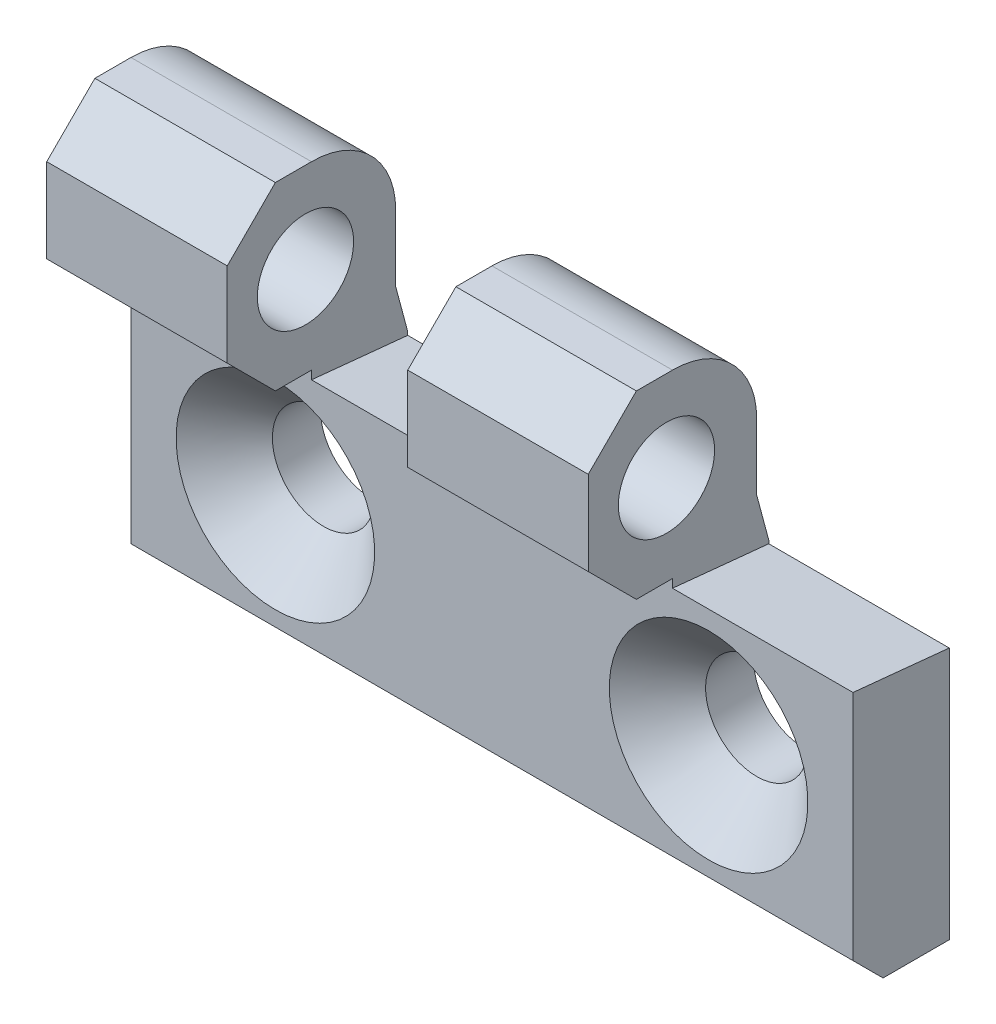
ISO-10303-21;
HEADER;
FILE_DESCRIPTION(('STEP AP214'),'2;1');
FILE_NAME('part.step','',(''),(''),'','','');
FILE_SCHEMA(('AUTOMOTIVE_DESIGN { 1 0 10303 214 1 1 1 1 }'));
ENDSEC;
DATA;
#1=APPLICATION_CONTEXT('core data for automotive mechanical design processes');
#2=APPLICATION_PROTOCOL_DEFINITION('international standard','automotive_design',2000,#1);
#3=PRODUCT_CONTEXT('',#1,'mechanical');
#4=PRODUCT('Part','Part','',(#3));
#5=PRODUCT_RELATED_PRODUCT_CATEGORY('part','',(#4));
#6=PRODUCT_DEFINITION_FORMATION('','',#4);
#7=PRODUCT_DEFINITION_CONTEXT('part definition',#1,'design');
#8=PRODUCT_DEFINITION('design','',#6,#7);
#9=PRODUCT_DEFINITION_SHAPE('','',#8);
#10=(LENGTH_UNIT() NAMED_UNIT(*) SI_UNIT(.MILLI.,.METRE.));
#11=(NAMED_UNIT(*) PLANE_ANGLE_UNIT() SI_UNIT($,.RADIAN.));
#12=(NAMED_UNIT(*) SI_UNIT($,.STERADIAN.) SOLID_ANGLE_UNIT());
#13=UNCERTAINTY_MEASURE_WITH_UNIT(LENGTH_MEASURE(1.E-05),#10,'distance_accuracy_value','');
#14=(GEOMETRIC_REPRESENTATION_CONTEXT(3) GLOBAL_UNCERTAINTY_ASSIGNED_CONTEXT((#13)) GLOBAL_UNIT_ASSIGNED_CONTEXT((#10,
#11,#12)) REPRESENTATION_CONTEXT('',''));
#15=CARTESIAN_POINT('',(0.,0.,0.));
#16=DIRECTION('',(0.,0.,1.));
#17=DIRECTION('',(1.,0.,0.));
#18=AXIS2_PLACEMENT_3D('',#15,#16,#17);
#19=CARTESIAN_POINT('',(-12.,9.,0.));
#20=DIRECTION('',(0.,0.995037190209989,-0.0995037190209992));
#21=DIRECTION('',(0.,0.0995037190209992,0.995037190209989));
#22=AXIS2_PLACEMENT_3D('',#19,#20,#21);
#23=PLANE('',#22);
#24=DIRECTION('',(0.,-0.0995037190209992,-0.995037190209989));
#25=VECTOR('',#24,1.);
#26=CARTESIAN_POINT('',(3.,9.,0.));
#27=LINE('',#26,#25);
#28=CARTESIAN_POINT('',(3.,9.8,8.));
#29=VERTEX_POINT('',#28);
#30=CARTESIAN_POINT('',(3.,9.,0.));
#31=VERTEX_POINT('',#30);
#32=EDGE_CURVE('E30',#29,#31,#27,.T.);
#33=ORIENTED_EDGE('',*,*,#32,.F.);
#34=DIRECTION('',(1.,0.,0.));
#35=VECTOR('',#34,1.);
#36=CARTESIAN_POINT('',(-12.,9.8,8.));
#37=LINE('',#36,#35);
#38=CARTESIAN_POINT('',(18.,9.8,8.));
#39=VERTEX_POINT('',#38);
#40=EDGE_CURVE('E402',#29,#39,#37,.T.);
#41=ORIENTED_EDGE('',*,*,#40,.T.);
#42=DIRECTION('',(0.,-0.0995037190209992,-0.995037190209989));
#43=VECTOR('',#42,1.);
#44=CARTESIAN_POINT('',(18.,9.,0.));
#45=LINE('',#44,#43);
#46=CARTESIAN_POINT('',(18.,9.,0.));
#47=VERTEX_POINT('',#46);
#48=EDGE_CURVE('E368',#39,#47,#45,.T.);
#49=ORIENTED_EDGE('',*,*,#48,.T.);
#50=DIRECTION('',(1.,0.,0.));
#51=VECTOR('',#50,1.);
#52=CARTESIAN_POINT('',(-12.,9.,0.));
#53=LINE('',#52,#51);
#54=EDGE_CURVE('E23',#31,#47,#53,.T.);
#55=ORIENTED_EDGE('',*,*,#54,.F.);
#56=EDGE_LOOP('',(#33,#41,#49,#55));
#57=FACE_BOUND('',#56,.T.);
#58=ADVANCED_FACE('F15',(#57),#23,.T.);
#59=CARTESIAN_POINT('',(-12.,-12.,5.5));
#60=DIRECTION('',(0.,-1.,0.));
#61=DIRECTION('',(1.,0.,0.));
#62=AXIS2_PLACEMENT_3D('',#59,#60,#61);
#63=PLANE('',#62);
#64=DIRECTION('',(1.,0.,0.));
#65=VECTOR('',#64,1.);
#66=CARTESIAN_POINT('',(-12.,-12.,0.));
#67=LINE('',#66,#65);
#68=CARTESIAN_POINT('',(-12.,-12.,0.));
#69=VERTEX_POINT('',#68);
#70=CARTESIAN_POINT('',(48.,-12.,0.));
#71=VERTEX_POINT('',#70);
#72=EDGE_CURVE('E9',#69,#71,#67,.T.);
#73=ORIENTED_EDGE('',*,*,#72,.T.);
#74=DIRECTION('',(0.,0.,-1.));
#75=VECTOR('',#74,1.);
#76=CARTESIAN_POINT('',(48.,-12.,5.5));
#77=LINE('',#76,#75);
#78=CARTESIAN_POINT('',(48.,-12.,5.5));
#79=VERTEX_POINT('',#78);
#80=EDGE_CURVE('E373',#79,#71,#77,.T.);
#81=ORIENTED_EDGE('',*,*,#80,.F.);
#82=DIRECTION('',(1.,0.,0.));
#83=VECTOR('',#82,1.);
#84=CARTESIAN_POINT('',(-12.,-12.,5.5));
#85=LINE('',#84,#83);
#86=CARTESIAN_POINT('',(-12.,-12.,5.5));
#87=VERTEX_POINT('',#86);
#88=EDGE_CURVE('E395',#87,#79,#85,.T.);
#89=ORIENTED_EDGE('',*,*,#88,.F.);
#90=DIRECTION('',(0.,0.,-1.));
#91=VECTOR('',#90,1.);
#92=CARTESIAN_POINT('',(-12.,-12.,5.5));
#93=LINE('',#92,#91);
#94=EDGE_CURVE('E386',#87,#69,#93,.T.);
#95=ORIENTED_EDGE('',*,*,#94,.T.);
#96=EDGE_LOOP('',(#73,#81,#89,#95));
#97=FACE_BOUND('',#96,.T.);
#98=ADVANCED_FACE('F17',(#97),#63,.T.);
#99=CARTESIAN_POINT('',(-12.,-12.,0.));
#100=DIRECTION('',(0.,0.,-1.));
#101=DIRECTION('',(-1.,0.,0.));
#102=AXIS2_PLACEMENT_3D('',#99,#100,#101);
#103=PLANE('',#102);
#104=CARTESIAN_POINT('',(0.,0.,0.));
#105=DIRECTION('',(0.,0.,1.));
#106=DIRECTION('',(0.,-1.,0.));
#107=AXIS2_PLACEMENT_3D('',#104,#105,#106);
#108=CIRCLE('',#107,4.25);
#109=CARTESIAN_POINT('',(0.,-4.25,0.));
#110=VERTEX_POINT('',#109);
#111=EDGE_CURVE('E537',#110,#110,#108,.T.);
#112=ORIENTED_EDGE('',*,*,#111,.T.);
#113=EDGE_LOOP('',(#112));
#114=FACE_BOUND('',#113,.T.);
#115=CARTESIAN_POINT('',(36.,0.,0.));
#116=DIRECTION('',(0.,0.,1.));
#117=DIRECTION('',(0.,-1.,0.));
#118=AXIS2_PLACEMENT_3D('',#115,#116,#117);
#119=CIRCLE('',#118,4.25);
#120=CARTESIAN_POINT('',(36.,-4.25,0.));
#121=VERTEX_POINT('',#120);
#122=EDGE_CURVE('E540',#121,#121,#119,.T.);
#123=ORIENTED_EDGE('',*,*,#122,.T.);
#124=EDGE_LOOP('',(#123));
#125=FACE_BOUND('',#124,.T.);
#126=DIRECTION('',(0.,1.,0.));
#127=VECTOR('',#126,1.);
#128=CARTESIAN_POINT('',(-12.,-12.,0.));
#129=LINE('',#128,#127);
#130=CARTESIAN_POINT('',(-12.,9.2679491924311,0.));
#131=VERTEX_POINT('',#130);
#132=EDGE_CURVE('E193',#69,#131,#129,.T.);
#133=ORIENTED_EDGE('',*,*,#132,.T.);
#134=DIRECTION('',(1.,0.,0.));
#135=VECTOR('',#134,1.);
#136=CARTESIAN_POINT('',(-12.,9.2679491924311,0.));
#137=LINE('',#136,#135);
#138=CARTESIAN_POINT('',(3.,9.2679491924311,0.));
#139=VERTEX_POINT('',#138);
#140=EDGE_CURVE('E190',#131,#139,#137,.T.);
#141=ORIENTED_EDGE('',*,*,#140,.T.);
#142=DIRECTION('',(0.,1.,0.));
#143=VECTOR('',#142,1.);
#144=CARTESIAN_POINT('',(3.,2.,0.));
#145=LINE('',#144,#143);
#146=EDGE_CURVE('E179',#31,#139,#145,.T.);
#147=ORIENTED_EDGE('',*,*,#146,.F.);
#148=ORIENTED_EDGE('',*,*,#54,.T.);
#149=DIRECTION('',(0.,1.,0.));
#150=VECTOR('',#149,1.);
#151=CARTESIAN_POINT('',(18.,2.,0.));
#152=LINE('',#151,#150);
#153=CARTESIAN_POINT('',(18.,9.2679491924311,0.));
#154=VERTEX_POINT('',#153);
#155=EDGE_CURVE('E283',#47,#154,#152,.T.);
#156=ORIENTED_EDGE('',*,*,#155,.T.);
#157=DIRECTION('',(-1.,0.,0.));
#158=VECTOR('',#157,1.);
#159=CARTESIAN_POINT('',(33.,9.2679491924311,0.));
#160=LINE('',#159,#158);
#161=CARTESIAN_POINT('',(33.,9.2679491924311,0.));
#162=VERTEX_POINT('',#161);
#163=EDGE_CURVE('E365',#162,#154,#160,.T.);
#164=ORIENTED_EDGE('',*,*,#163,.F.);
#165=DIRECTION('',(0.,1.,0.));
#166=VECTOR('',#165,1.);
#167=CARTESIAN_POINT('',(33.,2.,0.));
#168=LINE('',#167,#166);
#169=CARTESIAN_POINT('',(33.,9.,0.));
#170=VERTEX_POINT('',#169);
#171=EDGE_CURVE('E318',#170,#162,#168,.T.);
#172=ORIENTED_EDGE('',*,*,#171,.F.);
#173=CARTESIAN_POINT('',(48.,9.,0.));
#174=VERTEX_POINT('',#173);
#175=EDGE_CURVE('E403',#170,#174,#53,.T.);
#176=ORIENTED_EDGE('',*,*,#175,.T.);
#177=DIRECTION('',(0.,1.,0.));
#178=VECTOR('',#177,1.);
#179=CARTESIAN_POINT('',(48.,-12.,0.));
#180=LINE('',#179,#178);
#181=EDGE_CURVE('E374',#71,#174,#180,.T.);
#182=ORIENTED_EDGE('',*,*,#181,.F.);
#183=ORIENTED_EDGE('',*,*,#72,.F.);
#184=EDGE_LOOP('',(#133,#141,#147,#148,#156,#164,#172,#176,#182,#183));
#185=FACE_BOUND('',#184,.T.);
#186=ADVANCED_FACE('F191',(#114,#125,#185),#103,.T.);
#187=DIRECTION('',(0.,-0.0995037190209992,-0.995037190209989));
#188=VECTOR('',#187,1.);
#189=CARTESIAN_POINT('',(33.,9.,0.));
#190=LINE('',#189,#188);
#191=CARTESIAN_POINT('',(33.,9.8,8.));
#192=VERTEX_POINT('',#191);
#193=EDGE_CURVE('E371',#192,#170,#190,.T.);
#194=ORIENTED_EDGE('',*,*,#193,.F.);
#195=CARTESIAN_POINT('',(48.,9.8,8.));
#196=VERTEX_POINT('',#195);
#197=EDGE_CURVE('E401',#192,#196,#37,.T.);
#198=ORIENTED_EDGE('',*,*,#197,.T.);
#199=DIRECTION('',(0.,0.0995037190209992,0.995037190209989));
#200=VECTOR('',#199,1.);
#201=CARTESIAN_POINT('',(48.,9.,0.));
#202=LINE('',#201,#200);
#203=EDGE_CURVE('E377',#174,#196,#202,.T.);
#204=ORIENTED_EDGE('',*,*,#203,.F.);
#205=ORIENTED_EDGE('',*,*,#175,.F.);
#206=EDGE_LOOP('',(#194,#198,#204,#205));
#207=FACE_BOUND('',#206,.T.);
#208=ADVANCED_FACE('F415',(#207),#23,.T.);
#209=CARTESIAN_POINT('',(-12.,9.8,8.));
#210=DIRECTION('',(0.,0.,1.));
#211=DIRECTION('',(1.,0.,0.));
#212=AXIS2_PLACEMENT_3D('',#209,#210,#211);
#213=PLANE('',#212);
#214=CARTESIAN_POINT('',(0.,0.,8.));
#215=DIRECTION('',(0.,0.,1.));
#216=DIRECTION('',(0.,-1.,0.));
#217=AXIS2_PLACEMENT_3D('',#214,#215,#216);
#218=CIRCLE('',#217,8.25);
#219=CARTESIAN_POINT('',(0.,-8.25,8.));
#220=VERTEX_POINT('',#219);
#221=EDGE_CURVE('E543',#220,#220,#218,.T.);
#222=ORIENTED_EDGE('',*,*,#221,.F.);
#223=EDGE_LOOP('',(#222));
#224=FACE_BOUND('',#223,.T.);
#225=CARTESIAN_POINT('',(36.,0.,8.));
#226=DIRECTION('',(0.,0.,1.));
#227=DIRECTION('',(0.,-1.,0.));
#228=AXIS2_PLACEMENT_3D('',#225,#226,#227);
#229=CIRCLE('',#228,8.25);
#230=CARTESIAN_POINT('',(36.,-8.25,8.));
#231=VERTEX_POINT('',#230);
#232=EDGE_CURVE('E187',#231,#231,#229,.T.);
#233=ORIENTED_EDGE('',*,*,#232,.F.);
#234=EDGE_LOOP('',(#233));
#235=FACE_BOUND('',#234,.T.);
#236=DIRECTION('',(0.,-1.,0.));
#237=VECTOR('',#236,1.);
#238=CARTESIAN_POINT('',(-12.,9.8,8.));
#239=LINE('',#238,#237);
#240=CARTESIAN_POINT('',(-12.,10.5,8.));
#241=VERTEX_POINT('',#240);
#242=CARTESIAN_POINT('',(-12.,-9.5,8.));
#243=VERTEX_POINT('',#242);
#244=EDGE_CURVE('E390',#241,#243,#239,.T.);
#245=ORIENTED_EDGE('',*,*,#244,.T.);
#246=DIRECTION('',(1.,0.,0.));
#247=VECTOR('',#246,1.);
#248=CARTESIAN_POINT('',(-12.,-9.5,8.));
#249=LINE('',#248,#247);
#250=CARTESIAN_POINT('',(48.,-9.5,8.));
#251=VERTEX_POINT('',#250);
#252=EDGE_CURVE('E399',#243,#251,#249,.T.);
#253=ORIENTED_EDGE('',*,*,#252,.T.);
#254=DIRECTION('',(0.,-1.,0.));
#255=VECTOR('',#254,1.);
#256=CARTESIAN_POINT('',(48.,9.8,8.));
#257=LINE('',#256,#255);
#258=EDGE_CURVE('E380',#196,#251,#257,.T.);
#259=ORIENTED_EDGE('',*,*,#258,.F.);
#260=ORIENTED_EDGE('',*,*,#197,.F.);
#261=DIRECTION('',(0.,-1.,0.));
#262=VECTOR('',#261,1.);
#263=CARTESIAN_POINT('',(33.,10.5,8.));
#264=LINE('',#263,#262);
#265=CARTESIAN_POINT('',(33.,10.5,8.));
#266=VERTEX_POINT('',#265);
#267=EDGE_CURVE('E336',#266,#192,#264,.T.);
#268=ORIENTED_EDGE('',*,*,#267,.F.);
#269=DIRECTION('',(-1.,0.,0.));
#270=VECTOR('',#269,1.);
#271=CARTESIAN_POINT('',(33.,10.5,8.));
#272=LINE('',#271,#270);
#273=CARTESIAN_POINT('',(18.,10.5,8.));
#274=VERTEX_POINT('',#273);
#275=EDGE_CURVE('E341',#266,#274,#272,.T.);
#276=ORIENTED_EDGE('',*,*,#275,.T.);
#277=DIRECTION('',(0.,-1.,0.));
#278=VECTOR('',#277,1.);
#279=CARTESIAN_POINT('',(18.,10.5,8.));
#280=LINE('',#279,#278);
#281=EDGE_CURVE('E310',#274,#39,#280,.T.);
#282=ORIENTED_EDGE('',*,*,#281,.T.);
#283=ORIENTED_EDGE('',*,*,#40,.F.);
#284=DIRECTION('',(0.,-1.,0.));
#285=VECTOR('',#284,1.);
#286=CARTESIAN_POINT('',(3.,10.5,8.));
#287=LINE('',#286,#285);
#288=CARTESIAN_POINT('',(3.,10.5,8.));
#289=VERTEX_POINT('',#288);
#290=EDGE_CURVE('E234',#289,#29,#287,.T.);
#291=ORIENTED_EDGE('',*,*,#290,.F.);
#292=DIRECTION('',(1.,0.,0.));
#293=VECTOR('',#292,1.);
#294=CARTESIAN_POINT('',(-12.,10.5,8.));
#295=LINE('',#294,#293);
#296=EDGE_CURVE('E267',#241,#289,#295,.T.);
#297=ORIENTED_EDGE('',*,*,#296,.F.);
#298=EDGE_LOOP('',(#245,#253,#259,#260,#268,#276,#282,#283,#291,#297));
#299=FACE_BOUND('',#298,.T.);
#300=ADVANCED_FACE('F419',(#224,#235,#299),#213,.T.);
#301=CARTESIAN_POINT('',(-12.,-9.5,8.));
#302=DIRECTION('',(0.,-0.707106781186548,0.707106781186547));
#303=DIRECTION('',(0.,-0.707106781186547,-0.707106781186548));
#304=AXIS2_PLACEMENT_3D('',#301,#302,#303);
#305=PLANE('',#304);
#306=ORIENTED_EDGE('',*,*,#88,.T.);
#307=DIRECTION('',(0.,-0.707106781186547,-0.707106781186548));
#308=VECTOR('',#307,1.);
#309=CARTESIAN_POINT('',(48.,-9.5,8.));
#310=LINE('',#309,#308);
#311=EDGE_CURVE('E383',#251,#79,#310,.T.);
#312=ORIENTED_EDGE('',*,*,#311,.F.);
#313=ORIENTED_EDGE('',*,*,#252,.F.);
#314=DIRECTION('',(0.,-0.707106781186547,-0.707106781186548));
#315=VECTOR('',#314,1.);
#316=CARTESIAN_POINT('',(-12.,-9.5,8.));
#317=LINE('',#316,#315);
#318=EDGE_CURVE('E392',#243,#87,#317,.T.);
#319=ORIENTED_EDGE('',*,*,#318,.T.);
#320=EDGE_LOOP('',(#306,#312,#313,#319));
#321=FACE_BOUND('',#320,.T.);
#322=ADVANCED_FACE('F423',(#321),#305,.T.);
#323=CARTESIAN_POINT('',(-12.,-12.,0.));
#324=DIRECTION('',(1.,0.,0.));
#325=DIRECTION('',(0.,1.,0.));
#326=AXIS2_PLACEMENT_3D('',#323,#324,#325);
#327=PLANE('',#326);
#328=ORIENTED_EDGE('',*,*,#318,.F.);
#329=ORIENTED_EDGE('',*,*,#244,.F.);
#330=DIRECTION('',(0.,0.,-1.));
#331=VECTOR('',#330,1.);
#332=CARTESIAN_POINT('',(-12.,10.5,11.));
#333=LINE('',#332,#331);
#334=CARTESIAN_POINT('',(-12.,10.5,11.));
#335=VERTEX_POINT('',#334);
#336=EDGE_CURVE('E261',#335,#241,#333,.T.);
#337=ORIENTED_EDGE('',*,*,#336,.F.);
#338=DIRECTION('',(0.,-0.707106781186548,-0.707106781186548));
#339=VECTOR('',#338,1.);
#340=CARTESIAN_POINT('',(-12.,14.5,15.));
#341=LINE('',#340,#339);
#342=CARTESIAN_POINT('',(-12.,14.5,15.));
#343=VERTEX_POINT('',#342);
#344=EDGE_CURVE('E258',#343,#335,#341,.T.);
#345=ORIENTED_EDGE('',*,*,#344,.F.);
#346=DIRECTION('',(0.,-1.,0.));
#347=VECTOR('',#346,1.);
#348=CARTESIAN_POINT('',(-12.,21.5,15.));
#349=LINE('',#348,#347);
#350=CARTESIAN_POINT('',(-12.,21.5,15.));
#351=VERTEX_POINT('',#350);
#352=EDGE_CURVE('E255',#351,#343,#349,.T.);
#353=ORIENTED_EDGE('',*,*,#352,.F.);
#354=DIRECTION('',(0.,-0.707106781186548,0.707106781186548));
#355=VECTOR('',#354,1.);
#356=CARTESIAN_POINT('',(-12.,25.5,11.));
#357=LINE('',#356,#355);
#358=CARTESIAN_POINT('',(-12.,25.5,11.));
#359=VERTEX_POINT('',#358);
#360=EDGE_CURVE('E252',#359,#351,#357,.T.);
#361=ORIENTED_EDGE('',*,*,#360,.F.);
#362=DIRECTION('',(0.,0.,1.));
#363=VECTOR('',#362,1.);
#364=CARTESIAN_POINT('',(-12.,25.5,8.));
#365=LINE('',#364,#363);
#366=CARTESIAN_POINT('',(-12.,25.5,8.00000000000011));
#367=VERTEX_POINT('',#366);
#368=EDGE_CURVE('E249',#367,#359,#365,.T.);
#369=ORIENTED_EDGE('',*,*,#368,.F.);
#370=CARTESIAN_POINT('',(-12.,18.5,8.00000000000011));
#371=DIRECTION('',(1.,0.,0.));
#372=DIRECTION('',(0.,-1.,0.));
#373=AXIS2_PLACEMENT_3D('',#370,#371,#372);
#374=CIRCLE('',#373,7.00000000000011);
#375=CARTESIAN_POINT('',(-12.,18.5,1.));
#376=VERTEX_POINT('',#375);
#377=EDGE_CURVE('E246',#376,#367,#374,.T.);
#378=ORIENTED_EDGE('',*,*,#377,.F.);
#379=DIRECTION('',(0.,1.,0.));
#380=VECTOR('',#379,1.);
#381=CARTESIAN_POINT('',(-12.,13.,1.));
#382=LINE('',#381,#380);
#383=CARTESIAN_POINT('',(-12.,13.,1.));
#384=VERTEX_POINT('',#383);
#385=EDGE_CURVE('E243',#384,#376,#382,.T.);
#386=ORIENTED_EDGE('',*,*,#385,.F.);
#387=DIRECTION('',(0.,0.965925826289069,0.258819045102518));
#388=VECTOR('',#387,1.);
#389=CARTESIAN_POINT('',(-12.,9.2679491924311,0.));
#390=LINE('',#389,#388);
#391=EDGE_CURVE('E241',#131,#384,#390,.T.);
#392=ORIENTED_EDGE('',*,*,#391,.F.);
#393=ORIENTED_EDGE('',*,*,#132,.F.);
#394=ORIENTED_EDGE('',*,*,#94,.F.);
#395=EDGE_LOOP('',(#328,#329,#337,#345,#353,#361,#369,#378,#386,#392,#393,#394));
#396=FACE_BOUND('',#395,.T.);
#397=CARTESIAN_POINT('',(-12.,18.,8.5));
#398=DIRECTION('',(1.,0.,0.));
#399=DIRECTION('',(0.,1.,0.));
#400=AXIS2_PLACEMENT_3D('',#397,#398,#399);
#401=CIRCLE('',#400,4.);
#402=CARTESIAN_POINT('',(-12.,22.,8.5));
#403=VERTEX_POINT('',#402);
#404=EDGE_CURVE('E264',#403,#403,#401,.T.);
#405=ORIENTED_EDGE('',*,*,#404,.T.);
#406=EDGE_LOOP('',(#405));
#407=FACE_BOUND('',#406,.T.);
#408=ADVANCED_FACE('F428',(#396,#407),#327,.F.);
#409=CARTESIAN_POINT('',(48.,-12.,0.));
#410=DIRECTION('',(1.,0.,0.));
#411=DIRECTION('',(0.,1.,0.));
#412=AXIS2_PLACEMENT_3D('',#409,#410,#411);
#413=PLANE('',#412);
#414=ORIENTED_EDGE('',*,*,#80,.T.);
#415=ORIENTED_EDGE('',*,*,#181,.T.);
#416=ORIENTED_EDGE('',*,*,#203,.T.);
#417=ORIENTED_EDGE('',*,*,#258,.T.);
#418=ORIENTED_EDGE('',*,*,#311,.T.);
#419=EDGE_LOOP('',(#414,#415,#416,#417,#418));
#420=FACE_BOUND('',#419,.T.);
#421=ADVANCED_FACE('F412',(#420),#413,.T.);
#422=CARTESIAN_POINT('',(33.,9.2679491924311,0.));
#423=DIRECTION('',(0.,-0.258819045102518,0.965925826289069));
#424=DIRECTION('',(0.,-0.965925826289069,-0.258819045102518));
#425=AXIS2_PLACEMENT_3D('',#422,#423,#424);
#426=PLANE('',#425);
#427=DIRECTION('',(0.,0.965925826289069,0.258819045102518));
#428=VECTOR('',#427,1.);
#429=CARTESIAN_POINT('',(18.,9.2679491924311,0.));
#430=LINE('',#429,#428);
#431=CARTESIAN_POINT('',(18.,13.,1.));
#432=VERTEX_POINT('',#431);
#433=EDGE_CURVE('E286',#154,#432,#430,.T.);
#434=ORIENTED_EDGE('',*,*,#433,.T.);
#435=DIRECTION('',(-1.,0.,0.));
#436=VECTOR('',#435,1.);
#437=CARTESIAN_POINT('',(33.,13.,1.));
#438=LINE('',#437,#436);
#439=CARTESIAN_POINT('',(33.,13.,1.));
#440=VERTEX_POINT('',#439);
#441=EDGE_CURVE('E362',#440,#432,#438,.T.);
#442=ORIENTED_EDGE('',*,*,#441,.F.);
#443=DIRECTION('',(0.,0.965925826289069,0.258819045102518));
#444=VECTOR('',#443,1.);
#445=CARTESIAN_POINT('',(33.,9.2679491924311,0.));
#446=LINE('',#445,#444);
#447=EDGE_CURVE('E320',#162,#440,#446,.T.);
#448=ORIENTED_EDGE('',*,*,#447,.F.);
#449=ORIENTED_EDGE('',*,*,#163,.T.);
#450=EDGE_LOOP('',(#434,#442,#448,#449));
#451=FACE_BOUND('',#450,.T.);
#452=ADVANCED_FACE('F469',(#451),#426,.F.);
#453=CARTESIAN_POINT('',(33.,13.,1.));
#454=DIRECTION('',(0.,0.,1.));
#455=DIRECTION('',(1.,0.,0.));
#456=AXIS2_PLACEMENT_3D('',#453,#454,#455);
#457=PLANE('',#456);
#458=DIRECTION('',(0.,1.,0.));
#459=VECTOR('',#458,1.);
#460=CARTESIAN_POINT('',(18.,13.,1.));
#461=LINE('',#460,#459);
#462=CARTESIAN_POINT('',(18.,18.5,1.));
#463=VERTEX_POINT('',#462);
#464=EDGE_CURVE('E289',#432,#463,#461,.T.);
#465=ORIENTED_EDGE('',*,*,#464,.T.);
#466=DIRECTION('',(-1.,0.,0.));
#467=VECTOR('',#466,1.);
#468=CARTESIAN_POINT('',(33.,18.5,1.));
#469=LINE('',#468,#467);
#470=CARTESIAN_POINT('',(33.,18.5,1.));
#471=VERTEX_POINT('',#470);
#472=EDGE_CURVE('E359',#471,#463,#469,.T.);
#473=ORIENTED_EDGE('',*,*,#472,.F.);
#474=DIRECTION('',(0.,1.,0.));
#475=VECTOR('',#474,1.);
#476=CARTESIAN_POINT('',(33.,13.,1.));
#477=LINE('',#476,#475);
#478=EDGE_CURVE('E322',#440,#471,#477,.T.);
#479=ORIENTED_EDGE('',*,*,#478,.F.);
#480=ORIENTED_EDGE('',*,*,#441,.T.);
#481=EDGE_LOOP('',(#465,#473,#479,#480));
#482=FACE_BOUND('',#481,.T.);
#483=ADVANCED_FACE('F505',(#482),#457,.F.);
#484=CARTESIAN_POINT('',(33.,18.5,8.00000000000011));
#485=DIRECTION('',(-1.,0.,0.));
#486=DIRECTION('',(0.,-1.,0.));
#487=AXIS2_PLACEMENT_3D('',#484,#485,#486);
#488=CYLINDRICAL_SURFACE('',#487,7.00000000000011);
#489=CARTESIAN_POINT('',(18.,18.5,8.00000000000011));
#490=DIRECTION('',(1.,0.,0.));
#491=DIRECTION('',(0.,-1.,0.));
#492=AXIS2_PLACEMENT_3D('',#489,#490,#491);
#493=CIRCLE('',#492,7.00000000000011);
#494=CARTESIAN_POINT('',(18.,25.5,8.00000000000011));
#495=VERTEX_POINT('',#494);
#496=EDGE_CURVE('E292',#463,#495,#493,.T.);
#497=ORIENTED_EDGE('',*,*,#496,.T.);
#498=DIRECTION('',(-1.,0.,0.));
#499=VECTOR('',#498,1.);
#500=CARTESIAN_POINT('',(33.,25.5,8.00000000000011));
#501=LINE('',#500,#499);
#502=CARTESIAN_POINT('',(33.,25.5,8.00000000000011));
#503=VERTEX_POINT('',#502);
#504=EDGE_CURVE('E356',#503,#495,#501,.T.);
#505=ORIENTED_EDGE('',*,*,#504,.F.);
#506=CARTESIAN_POINT('',(33.,18.5,8.00000000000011));
#507=DIRECTION('',(1.,0.,0.));
#508=DIRECTION('',(0.,-1.,0.));
#509=AXIS2_PLACEMENT_3D('',#506,#507,#508);
#510=CIRCLE('',#509,7.00000000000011);
#511=EDGE_CURVE('E324',#471,#503,#510,.T.);
#512=ORIENTED_EDGE('',*,*,#511,.F.);
#513=ORIENTED_EDGE('',*,*,#472,.T.);
#514=EDGE_LOOP('',(#497,#505,#512,#513));
#515=FACE_BOUND('',#514,.T.);
#516=ADVANCED_FACE('F503',(#515),#488,.T.);
#517=CARTESIAN_POINT('',(33.,25.5,8.));
#518=DIRECTION('',(0.,-1.,0.));
#519=DIRECTION('',(1.,0.,0.));
#520=AXIS2_PLACEMENT_3D('',#517,#518,#519);
#521=PLANE('',#520);
#522=DIRECTION('',(0.,0.,1.));
#523=VECTOR('',#522,1.);
#524=CARTESIAN_POINT('',(18.,25.5,8.));
#525=LINE('',#524,#523);
#526=CARTESIAN_POINT('',(18.,25.5,11.));
#527=VERTEX_POINT('',#526);
#528=EDGE_CURVE('E295',#495,#527,#525,.T.);
#529=ORIENTED_EDGE('',*,*,#528,.T.);
#530=DIRECTION('',(-1.,0.,0.));
#531=VECTOR('',#530,1.);
#532=CARTESIAN_POINT('',(33.,25.5,11.));
#533=LINE('',#532,#531);
#534=CARTESIAN_POINT('',(33.,25.5,11.));
#535=VERTEX_POINT('',#534);
#536=EDGE_CURVE('E353',#535,#527,#533,.T.);
#537=ORIENTED_EDGE('',*,*,#536,.F.);
#538=DIRECTION('',(0.,0.,1.));
#539=VECTOR('',#538,1.);
#540=CARTESIAN_POINT('',(33.,25.5,8.));
#541=LINE('',#540,#539);
#542=EDGE_CURVE('E326',#503,#535,#541,.T.);
#543=ORIENTED_EDGE('',*,*,#542,.F.);
#544=ORIENTED_EDGE('',*,*,#504,.T.);
#545=EDGE_LOOP('',(#529,#537,#543,#544));
#546=FACE_BOUND('',#545,.T.);
#547=ADVANCED_FACE('F498',(#546),#521,.F.);
#548=CARTESIAN_POINT('',(33.,25.5,11.));
#549=DIRECTION('',(0.,-0.707106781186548,-0.707106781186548));
#550=DIRECTION('',(0.,0.707106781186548,-0.707106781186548));
#551=AXIS2_PLACEMENT_3D('',#548,#549,#550);
#552=PLANE('',#551);
#553=DIRECTION('',(0.,-0.707106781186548,0.707106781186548));
#554=VECTOR('',#553,1.);
#555=CARTESIAN_POINT('',(18.,25.5,11.));
#556=LINE('',#555,#554);
#557=CARTESIAN_POINT('',(18.,21.5,15.));
#558=VERTEX_POINT('',#557);
#559=EDGE_CURVE('E298',#527,#558,#556,.T.);
#560=ORIENTED_EDGE('',*,*,#559,.T.);
#561=DIRECTION('',(-1.,0.,0.));
#562=VECTOR('',#561,1.);
#563=CARTESIAN_POINT('',(33.,21.5,15.));
#564=LINE('',#563,#562);
#565=CARTESIAN_POINT('',(33.,21.5,15.));
#566=VERTEX_POINT('',#565);
#567=EDGE_CURVE('E350',#566,#558,#564,.T.);
#568=ORIENTED_EDGE('',*,*,#567,.F.);
#569=DIRECTION('',(0.,-0.707106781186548,0.707106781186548));
#570=VECTOR('',#569,1.);
#571=CARTESIAN_POINT('',(33.,25.5,11.));
#572=LINE('',#571,#570);
#573=EDGE_CURVE('E328',#535,#566,#572,.T.);
#574=ORIENTED_EDGE('',*,*,#573,.F.);
#575=ORIENTED_EDGE('',*,*,#536,.T.);
#576=EDGE_LOOP('',(#560,#568,#574,#575));
#577=FACE_BOUND('',#576,.T.);
#578=ADVANCED_FACE('F493',(#577),#552,.F.);
#579=CARTESIAN_POINT('',(33.,21.5,15.));
#580=DIRECTION('',(0.,0.,-1.));
#581=DIRECTION('',(-1.,0.,0.));
#582=AXIS2_PLACEMENT_3D('',#579,#580,#581);
#583=PLANE('',#582);
#584=DIRECTION('',(0.,-1.,0.));
#585=VECTOR('',#584,1.);
#586=CARTESIAN_POINT('',(18.,21.5,15.));
#587=LINE('',#586,#585);
#588=CARTESIAN_POINT('',(18.,14.5,15.));
#589=VERTEX_POINT('',#588);
#590=EDGE_CURVE('E301',#558,#589,#587,.T.);
#591=ORIENTED_EDGE('',*,*,#590,.T.);
#592=DIRECTION('',(-1.,0.,0.));
#593=VECTOR('',#592,1.);
#594=CARTESIAN_POINT('',(33.,14.5,15.));
#595=LINE('',#594,#593);
#596=CARTESIAN_POINT('',(33.,14.5,15.));
#597=VERTEX_POINT('',#596);
#598=EDGE_CURVE('E347',#597,#589,#595,.T.);
#599=ORIENTED_EDGE('',*,*,#598,.F.);
#600=DIRECTION('',(0.,-1.,0.));
#601=VECTOR('',#600,1.);
#602=CARTESIAN_POINT('',(33.,21.5,15.));
#603=LINE('',#602,#601);
#604=EDGE_CURVE('E330',#566,#597,#603,.T.);
#605=ORIENTED_EDGE('',*,*,#604,.F.);
#606=ORIENTED_EDGE('',*,*,#567,.T.);
#607=EDGE_LOOP('',(#591,#599,#605,#606));
#608=FACE_BOUND('',#607,.T.);
#609=ADVANCED_FACE('F489',(#608),#583,.F.);
#610=CARTESIAN_POINT('',(33.,14.5,15.));
#611=DIRECTION('',(0.,0.707106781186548,-0.707106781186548));
#612=DIRECTION('',(0.,0.707106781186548,0.707106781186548));
#613=AXIS2_PLACEMENT_3D('',#610,#611,#612);
#614=PLANE('',#613);
#615=DIRECTION('',(0.,-0.707106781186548,-0.707106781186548));
#616=VECTOR('',#615,1.);
#617=CARTESIAN_POINT('',(18.,14.5,15.));
#618=LINE('',#617,#616);
#619=CARTESIAN_POINT('',(18.,10.5,11.));
#620=VERTEX_POINT('',#619);
#621=EDGE_CURVE('E304',#589,#620,#618,.T.);
#622=ORIENTED_EDGE('',*,*,#621,.T.);
#623=DIRECTION('',(-1.,0.,0.));
#624=VECTOR('',#623,1.);
#625=CARTESIAN_POINT('',(33.,10.5,11.));
#626=LINE('',#625,#624);
#627=CARTESIAN_POINT('',(33.,10.5,11.));
#628=VERTEX_POINT('',#627);
#629=EDGE_CURVE('E344',#628,#620,#626,.T.);
#630=ORIENTED_EDGE('',*,*,#629,.F.);
#631=DIRECTION('',(0.,-0.707106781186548,-0.707106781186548));
#632=VECTOR('',#631,1.);
#633=CARTESIAN_POINT('',(33.,14.5,15.));
#634=LINE('',#633,#632);
#635=EDGE_CURVE('E332',#597,#628,#634,.T.);
#636=ORIENTED_EDGE('',*,*,#635,.F.);
#637=ORIENTED_EDGE('',*,*,#598,.T.);
#638=EDGE_LOOP('',(#622,#630,#636,#637));
#639=FACE_BOUND('',#638,.T.);
#640=ADVANCED_FACE('F485',(#639),#614,.F.);
#641=CARTESIAN_POINT('',(33.,10.5,11.));
#642=DIRECTION('',(0.,1.,0.));
#643=DIRECTION('',(-1.,0.,0.));
#644=AXIS2_PLACEMENT_3D('',#641,#642,#643);
#645=PLANE('',#644);
#646=DIRECTION('',(0.,0.,-1.));
#647=VECTOR('',#646,1.);
#648=CARTESIAN_POINT('',(18.,10.5,11.));
#649=LINE('',#648,#647);
#650=EDGE_CURVE('E307',#620,#274,#649,.T.);
#651=ORIENTED_EDGE('',*,*,#650,.T.);
#652=ORIENTED_EDGE('',*,*,#275,.F.);
#653=DIRECTION('',(0.,0.,-1.));
#654=VECTOR('',#653,1.);
#655=CARTESIAN_POINT('',(33.,10.5,11.));
#656=LINE('',#655,#654);
#657=EDGE_CURVE('E334',#628,#266,#656,.T.);
#658=ORIENTED_EDGE('',*,*,#657,.F.);
#659=ORIENTED_EDGE('',*,*,#629,.T.);
#660=EDGE_LOOP('',(#651,#652,#658,#659));
#661=FACE_BOUND('',#660,.T.);
#662=ADVANCED_FACE('F480',(#661),#645,.F.);
#663=CARTESIAN_POINT('',(33.,18.,8.5));
#664=DIRECTION('',(-1.,0.,0.));
#665=DIRECTION('',(0.,-1.,0.));
#666=AXIS2_PLACEMENT_3D('',#663,#664,#665);
#667=CYLINDRICAL_SURFACE('',#666,4.);
#668=CARTESIAN_POINT('',(33.,18.,8.5));
#669=DIRECTION('',(1.,0.,0.));
#670=DIRECTION('',(0.,1.,0.));
#671=AXIS2_PLACEMENT_3D('',#668,#669,#670);
#672=CIRCLE('',#671,4.);
#673=CARTESIAN_POINT('',(33.,22.,8.5));
#674=VERTEX_POINT('',#673);
#675=EDGE_CURVE('E338',#674,#674,#672,.T.);
#676=ORIENTED_EDGE('',*,*,#675,.T.);
#677=EDGE_LOOP('',(#676));
#678=FACE_BOUND('',#677,.T.);
#679=CARTESIAN_POINT('',(18.,18.,8.5));
#680=DIRECTION('',(1.,0.,0.));
#681=DIRECTION('',(0.,1.,0.));
#682=AXIS2_PLACEMENT_3D('',#679,#680,#681);
#683=CIRCLE('',#682,4.);
#684=CARTESIAN_POINT('',(18.,22.,8.5));
#685=VERTEX_POINT('',#684);
#686=EDGE_CURVE('E314',#685,#685,#683,.T.);
#687=ORIENTED_EDGE('',*,*,#686,.F.);
#688=EDGE_LOOP('',(#687));
#689=FACE_BOUND('',#688,.T.);
#690=ADVANCED_FACE('F596',(#678,#689),#667,.F.);
#691=CARTESIAN_POINT('',(33.,18.5,8.00000000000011));
#692=DIRECTION('',(1.,0.,0.));
#693=DIRECTION('',(0.,1.,0.));
#694=AXIS2_PLACEMENT_3D('',#691,#692,#693);
#695=PLANE('',#694);
#696=ORIENTED_EDGE('',*,*,#675,.F.);
#697=EDGE_LOOP('',(#696));
#698=FACE_BOUND('',#697,.T.);
#699=ORIENTED_EDGE('',*,*,#267,.T.);
#700=ORIENTED_EDGE('',*,*,#193,.T.);
#701=ORIENTED_EDGE('',*,*,#171,.T.);
#702=ORIENTED_EDGE('',*,*,#447,.T.);
#703=ORIENTED_EDGE('',*,*,#478,.T.);
#704=ORIENTED_EDGE('',*,*,#511,.T.);
#705=ORIENTED_EDGE('',*,*,#542,.T.);
#706=ORIENTED_EDGE('',*,*,#573,.T.);
#707=ORIENTED_EDGE('',*,*,#604,.T.);
#708=ORIENTED_EDGE('',*,*,#635,.T.);
#709=ORIENTED_EDGE('',*,*,#657,.T.);
#710=EDGE_LOOP('',(#699,#700,#701,#702,#703,#704,#705,#706,#707,#708,#709));
#711=FACE_BOUND('',#710,.T.);
#712=ADVANCED_FACE('F473',(#698,#711),#695,.T.);
#713=CARTESIAN_POINT('',(18.,18.5,8.00000000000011));
#714=DIRECTION('',(1.,0.,0.));
#715=DIRECTION('',(0.,1.,0.));
#716=AXIS2_PLACEMENT_3D('',#713,#714,#715);
#717=PLANE('',#716);
#718=ORIENTED_EDGE('',*,*,#48,.F.);
#719=ORIENTED_EDGE('',*,*,#281,.F.);
#720=ORIENTED_EDGE('',*,*,#650,.F.);
#721=ORIENTED_EDGE('',*,*,#621,.F.);
#722=ORIENTED_EDGE('',*,*,#590,.F.);
#723=ORIENTED_EDGE('',*,*,#559,.F.);
#724=ORIENTED_EDGE('',*,*,#528,.F.);
#725=ORIENTED_EDGE('',*,*,#496,.F.);
#726=ORIENTED_EDGE('',*,*,#464,.F.);
#727=ORIENTED_EDGE('',*,*,#433,.F.);
#728=ORIENTED_EDGE('',*,*,#155,.F.);
#729=EDGE_LOOP('',(#718,#719,#720,#721,#722,#723,#724,#725,#726,#727,#728));
#730=FACE_BOUND('',#729,.T.);
#731=ORIENTED_EDGE('',*,*,#686,.T.);
#732=EDGE_LOOP('',(#731));
#733=FACE_BOUND('',#732,.T.);
#734=ADVANCED_FACE('F462',(#730,#733),#717,.F.);
#735=CARTESIAN_POINT('',(-12.,9.2679491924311,0.));
#736=DIRECTION('',(0.,0.258819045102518,-0.965925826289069));
#737=DIRECTION('',(0.,0.965925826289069,0.258819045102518));
#738=AXIS2_PLACEMENT_3D('',#735,#736,#737);
#739=PLANE('',#738);
#740=DIRECTION('',(0.,0.965925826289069,0.258819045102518));
#741=VECTOR('',#740,1.);
#742=CARTESIAN_POINT('',(3.,9.2679491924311,0.));
#743=LINE('',#742,#741);
#744=CARTESIAN_POINT('',(3.,13.,1.));
#745=VERTEX_POINT('',#744);
#746=EDGE_CURVE('E185',#139,#745,#743,.T.);
#747=ORIENTED_EDGE('',*,*,#746,.F.);
#748=ORIENTED_EDGE('',*,*,#140,.F.);
#749=ORIENTED_EDGE('',*,*,#391,.T.);
#750=DIRECTION('',(1.,0.,0.));
#751=VECTOR('',#750,1.);
#752=CARTESIAN_POINT('',(-12.,13.,1.));
#753=LINE('',#752,#751);
#754=EDGE_CURVE('E197',#384,#745,#753,.T.);
#755=ORIENTED_EDGE('',*,*,#754,.T.);
#756=EDGE_LOOP('',(#747,#748,#749,#755));
#757=FACE_BOUND('',#756,.T.);
#758=ADVANCED_FACE('F199',(#757),#739,.T.);
#759=CARTESIAN_POINT('',(-12.,13.,1.));
#760=DIRECTION('',(0.,0.,-1.));
#761=DIRECTION('',(-1.,0.,0.));
#762=AXIS2_PLACEMENT_3D('',#759,#760,#761);
#763=PLANE('',#762);
#764=DIRECTION('',(0.,1.,0.));
#765=VECTOR('',#764,1.);
#766=CARTESIAN_POINT('',(3.,13.,1.));
#767=LINE('',#766,#765);
#768=CARTESIAN_POINT('',(3.,18.5,1.));
#769=VERTEX_POINT('',#768);
#770=EDGE_CURVE('E202',#745,#769,#767,.T.);
#771=ORIENTED_EDGE('',*,*,#770,.F.);
#772=ORIENTED_EDGE('',*,*,#754,.F.);
#773=ORIENTED_EDGE('',*,*,#385,.T.);
#774=DIRECTION('',(1.,0.,0.));
#775=VECTOR('',#774,1.);
#776=CARTESIAN_POINT('',(-12.,18.5,1.));
#777=LINE('',#776,#775);
#778=EDGE_CURVE('E279',#376,#769,#777,.T.);
#779=ORIENTED_EDGE('',*,*,#778,.T.);
#780=EDGE_LOOP('',(#771,#772,#773,#779));
#781=FACE_BOUND('',#780,.T.);
#782=ADVANCED_FACE('F434',(#781),#763,.T.);
#783=CARTESIAN_POINT('',(-12.,18.5,8.00000000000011));
#784=DIRECTION('',(1.,0.,0.));
#785=DIRECTION('',(0.,1.,0.));
#786=AXIS2_PLACEMENT_3D('',#783,#784,#785);
#787=CYLINDRICAL_SURFACE('',#786,7.00000000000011);
#788=CARTESIAN_POINT('',(3.,18.5,8.00000000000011));
#789=DIRECTION('',(1.,0.,0.));
#790=DIRECTION('',(0.,-1.,0.));
#791=AXIS2_PLACEMENT_3D('',#788,#789,#790);
#792=CIRCLE('',#791,7.00000000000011);
#793=CARTESIAN_POINT('',(3.,25.5,8.00000000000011));
#794=VERTEX_POINT('',#793);
#795=EDGE_CURVE('E207',#769,#794,#792,.T.);
#796=ORIENTED_EDGE('',*,*,#795,.F.);
#797=ORIENTED_EDGE('',*,*,#778,.F.);
#798=ORIENTED_EDGE('',*,*,#377,.T.);
#799=DIRECTION('',(1.,0.,0.));
#800=VECTOR('',#799,1.);
#801=CARTESIAN_POINT('',(-12.,25.5,8.00000000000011));
#802=LINE('',#801,#800);
#803=EDGE_CURVE('E277',#367,#794,#802,.T.);
#804=ORIENTED_EDGE('',*,*,#803,.T.);
#805=EDGE_LOOP('',(#796,#797,#798,#804));
#806=FACE_BOUND('',#805,.T.);
#807=ADVANCED_FACE('F438',(#806),#787,.T.);
#808=CARTESIAN_POINT('',(-12.,25.5,8.));
#809=DIRECTION('',(0.,1.,0.));
#810=DIRECTION('',(-1.,0.,0.));
#811=AXIS2_PLACEMENT_3D('',#808,#809,#810);
#812=PLANE('',#811);
#813=DIRECTION('',(0.,0.,1.));
#814=VECTOR('',#813,1.);
#815=CARTESIAN_POINT('',(3.,25.5,8.));
#816=LINE('',#815,#814);
#817=CARTESIAN_POINT('',(3.,25.5,11.));
#818=VERTEX_POINT('',#817);
#819=EDGE_CURVE('E214',#794,#818,#816,.T.);
#820=ORIENTED_EDGE('',*,*,#819,.F.);
#821=ORIENTED_EDGE('',*,*,#803,.F.);
#822=ORIENTED_EDGE('',*,*,#368,.T.);
#823=DIRECTION('',(1.,0.,0.));
#824=VECTOR('',#823,1.);
#825=CARTESIAN_POINT('',(-12.,25.5,11.));
#826=LINE('',#825,#824);
#827=EDGE_CURVE('E275',#359,#818,#826,.T.);
#828=ORIENTED_EDGE('',*,*,#827,.T.);
#829=EDGE_LOOP('',(#820,#821,#822,#828));
#830=FACE_BOUND('',#829,.T.);
#831=ADVANCED_FACE('F440',(#830),#812,.T.);
#832=CARTESIAN_POINT('',(-12.,25.5,11.));
#833=DIRECTION('',(0.,0.707106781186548,0.707106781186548));
#834=DIRECTION('',(0.,-0.707106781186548,0.707106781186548));
#835=AXIS2_PLACEMENT_3D('',#832,#833,#834);
#836=PLANE('',#835);
#837=DIRECTION('',(0.,-0.707106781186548,0.707106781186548));
#838=VECTOR('',#837,1.);
#839=CARTESIAN_POINT('',(3.,25.5,11.));
#840=LINE('',#839,#838);
#841=CARTESIAN_POINT('',(3.,21.5,15.));
#842=VERTEX_POINT('',#841);
#843=EDGE_CURVE('E218',#818,#842,#840,.T.);
#844=ORIENTED_EDGE('',*,*,#843,.F.);
#845=ORIENTED_EDGE('',*,*,#827,.F.);
#846=ORIENTED_EDGE('',*,*,#360,.T.);
#847=DIRECTION('',(1.,0.,0.));
#848=VECTOR('',#847,1.);
#849=CARTESIAN_POINT('',(-12.,21.5,15.));
#850=LINE('',#849,#848);
#851=EDGE_CURVE('E273',#351,#842,#850,.T.);
#852=ORIENTED_EDGE('',*,*,#851,.T.);
#853=EDGE_LOOP('',(#844,#845,#846,#852));
#854=FACE_BOUND('',#853,.T.);
#855=ADVANCED_FACE('F444',(#854),#836,.T.);
#856=CARTESIAN_POINT('',(-12.,21.5,15.));
#857=DIRECTION('',(0.,0.,1.));
#858=DIRECTION('',(1.,0.,0.));
#859=AXIS2_PLACEMENT_3D('',#856,#857,#858);
#860=PLANE('',#859);
#861=DIRECTION('',(0.,-1.,0.));
#862=VECTOR('',#861,1.);
#863=CARTESIAN_POINT('',(3.,21.5,15.));
#864=LINE('',#863,#862);
#865=CARTESIAN_POINT('',(3.,14.5,15.));
#866=VERTEX_POINT('',#865);
#867=EDGE_CURVE('E222',#842,#866,#864,.T.);
#868=ORIENTED_EDGE('',*,*,#867,.F.);
#869=ORIENTED_EDGE('',*,*,#851,.F.);
#870=ORIENTED_EDGE('',*,*,#352,.T.);
#871=DIRECTION('',(1.,0.,0.));
#872=VECTOR('',#871,1.);
#873=CARTESIAN_POINT('',(-12.,14.5,15.));
#874=LINE('',#873,#872);
#875=EDGE_CURVE('E271',#343,#866,#874,.T.);
#876=ORIENTED_EDGE('',*,*,#875,.T.);
#877=EDGE_LOOP('',(#868,#869,#870,#876));
#878=FACE_BOUND('',#877,.T.);
#879=ADVANCED_FACE('F448',(#878),#860,.T.);
#880=CARTESIAN_POINT('',(-12.,14.5,15.));
#881=DIRECTION('',(0.,-0.707106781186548,0.707106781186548));
#882=DIRECTION('',(0.,-0.707106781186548,-0.707106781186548));
#883=AXIS2_PLACEMENT_3D('',#880,#881,#882);
#884=PLANE('',#883);
#885=DIRECTION('',(0.,-0.707106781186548,-0.707106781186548));
#886=VECTOR('',#885,1.);
#887=CARTESIAN_POINT('',(3.,14.5,15.));
#888=LINE('',#887,#886);
#889=CARTESIAN_POINT('',(3.,10.5,11.));
#890=VERTEX_POINT('',#889);
#891=EDGE_CURVE('E226',#866,#890,#888,.T.);
#892=ORIENTED_EDGE('',*,*,#891,.F.);
#893=ORIENTED_EDGE('',*,*,#875,.F.);
#894=ORIENTED_EDGE('',*,*,#344,.T.);
#895=DIRECTION('',(1.,0.,0.));
#896=VECTOR('',#895,1.);
#897=CARTESIAN_POINT('',(-12.,10.5,11.));
#898=LINE('',#897,#896);
#899=EDGE_CURVE('E269',#335,#890,#898,.T.);
#900=ORIENTED_EDGE('',*,*,#899,.T.);
#901=EDGE_LOOP('',(#892,#893,#894,#900));
#902=FACE_BOUND('',#901,.T.);
#903=ADVANCED_FACE('F452',(#902),#884,.T.);
#904=CARTESIAN_POINT('',(-12.,10.5,11.));
#905=DIRECTION('',(0.,-1.,0.));
#906=DIRECTION('',(1.,0.,0.));
#907=AXIS2_PLACEMENT_3D('',#904,#905,#906);
#908=PLANE('',#907);
#909=DIRECTION('',(0.,0.,-1.));
#910=VECTOR('',#909,1.);
#911=CARTESIAN_POINT('',(3.,10.5,11.));
#912=LINE('',#911,#910);
#913=EDGE_CURVE('E230',#890,#289,#912,.T.);
#914=ORIENTED_EDGE('',*,*,#913,.F.);
#915=ORIENTED_EDGE('',*,*,#899,.F.);
#916=ORIENTED_EDGE('',*,*,#336,.T.);
#917=ORIENTED_EDGE('',*,*,#296,.T.);
#918=EDGE_LOOP('',(#914,#915,#916,#917));
#919=FACE_BOUND('',#918,.T.);
#920=ADVANCED_FACE('F456',(#919),#908,.T.);
#921=CARTESIAN_POINT('',(-12.,18.,8.5));
#922=DIRECTION('',(1.,0.,0.));
#923=DIRECTION('',(0.,1.,0.));
#924=AXIS2_PLACEMENT_3D('',#921,#922,#923);
#925=CYLINDRICAL_SURFACE('',#924,4.);
#926=ORIENTED_EDGE('',*,*,#404,.F.);
#927=EDGE_LOOP('',(#926));
#928=FACE_BOUND('',#927,.T.);
#929=CARTESIAN_POINT('',(3.,18.,8.5));
#930=DIRECTION('',(1.,0.,0.));
#931=DIRECTION('',(0.,1.,0.));
#932=AXIS2_PLACEMENT_3D('',#929,#930,#931);
#933=CIRCLE('',#932,4.);
#934=CARTESIAN_POINT('',(3.,22.,8.5));
#935=VERTEX_POINT('',#934);
#936=EDGE_CURVE('E237',#935,#935,#933,.T.);
#937=ORIENTED_EDGE('',*,*,#936,.T.);
#938=EDGE_LOOP('',(#937));
#939=FACE_BOUND('',#938,.T.);
#940=ADVANCED_FACE('F567',(#928,#939),#925,.F.);
#941=CARTESIAN_POINT('',(3.,18.5,8.00000000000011));
#942=DIRECTION('',(1.,0.,0.));
#943=DIRECTION('',(0.,1.,0.));
#944=AXIS2_PLACEMENT_3D('',#941,#942,#943);
#945=PLANE('',#944);
#946=ORIENTED_EDGE('',*,*,#936,.F.);
#947=EDGE_LOOP('',(#946));
#948=FACE_BOUND('',#947,.T.);
#949=ORIENTED_EDGE('',*,*,#290,.T.);
#950=ORIENTED_EDGE('',*,*,#32,.T.);
#951=ORIENTED_EDGE('',*,*,#146,.T.);
#952=ORIENTED_EDGE('',*,*,#746,.T.);
#953=ORIENTED_EDGE('',*,*,#770,.T.);
#954=ORIENTED_EDGE('',*,*,#795,.T.);
#955=ORIENTED_EDGE('',*,*,#819,.T.);
#956=ORIENTED_EDGE('',*,*,#843,.T.);
#957=ORIENTED_EDGE('',*,*,#867,.T.);
#958=ORIENTED_EDGE('',*,*,#891,.T.);
#959=ORIENTED_EDGE('',*,*,#913,.T.);
#960=EDGE_LOOP('',(#949,#950,#951,#952,#953,#954,#955,#956,#957,#958,#959));
#961=FACE_BOUND('',#960,.T.);
#962=ADVANCED_FACE('F182',(#948,#961),#945,.T.);
#963=CARTESIAN_POINT('',(36.,0.,8.));
#964=DIRECTION('',(0.,0.,1.));
#965=DIRECTION('',(0.,-1.,0.));
#966=AXIS2_PLACEMENT_3D('',#963,#964,#965);
#967=CONICAL_SURFACE('',#966,8.25,0.785398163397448);
#968=CARTESIAN_POINT('',(36.,0.,4.));
#969=DIRECTION('',(0.,0.,1.));
#970=DIRECTION('',(0.,-1.,0.));
#971=AXIS2_PLACEMENT_3D('',#968,#969,#970);
#972=CIRCLE('',#971,4.25);
#973=CARTESIAN_POINT('',(36.,-4.25,4.));
#974=VERTEX_POINT('',#973);
#975=EDGE_CURVE('E542',#974,#974,#972,.T.);
#976=ORIENTED_EDGE('',*,*,#975,.F.);
#977=EDGE_LOOP('',(#976));
#978=FACE_BOUND('',#977,.T.);
#979=ORIENTED_EDGE('',*,*,#232,.T.);
#980=EDGE_LOOP('',(#979));
#981=FACE_BOUND('',#980,.T.);
#982=ADVANCED_FACE('F554',(#978,#981),#967,.F.);
#983=CARTESIAN_POINT('',(36.,0.,0.));
#984=DIRECTION('',(0.,0.,1.));
#985=DIRECTION('',(0.,-1.,0.));
#986=AXIS2_PLACEMENT_3D('',#983,#984,#985);
#987=CYLINDRICAL_SURFACE('',#986,4.25);
#988=ORIENTED_EDGE('',*,*,#122,.F.);
#989=EDGE_LOOP('',(#988));
#990=FACE_BOUND('',#989,.T.);
#991=ORIENTED_EDGE('',*,*,#975,.T.);
#992=EDGE_LOOP('',(#991));
#993=FACE_BOUND('',#992,.T.);
#994=ADVANCED_FACE('F557',(#990,#993),#987,.F.);
#995=CARTESIAN_POINT('',(0.,0.,8.));
#996=DIRECTION('',(0.,0.,1.));
#997=DIRECTION('',(0.,-1.,0.));
#998=AXIS2_PLACEMENT_3D('',#995,#996,#997);
#999=CONICAL_SURFACE('',#998,8.25,0.785398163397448);
#1000=CARTESIAN_POINT('',(0.,0.,4.));
#1001=DIRECTION('',(0.,0.,1.));
#1002=DIRECTION('',(0.,-1.,0.));
#1003=AXIS2_PLACEMENT_3D('',#1000,#1001,#1002);
#1004=CIRCLE('',#1003,4.25);
#1005=CARTESIAN_POINT('',(0.,-4.25,4.));
#1006=VERTEX_POINT('',#1005);
#1007=EDGE_CURVE('E548',#1006,#1006,#1004,.T.);
#1008=ORIENTED_EDGE('',*,*,#1007,.F.);
#1009=EDGE_LOOP('',(#1008));
#1010=FACE_BOUND('',#1009,.T.);
#1011=ORIENTED_EDGE('',*,*,#221,.T.);
#1012=EDGE_LOOP('',(#1011));
#1013=FACE_BOUND('',#1012,.T.);
#1014=ADVANCED_FACE('F565',(#1010,#1013),#999,.F.);
#1015=CARTESIAN_POINT('',(0.,0.,0.));
#1016=DIRECTION('',(0.,0.,1.));
#1017=DIRECTION('',(0.,-1.,0.));
#1018=AXIS2_PLACEMENT_3D('',#1015,#1016,#1017);
#1019=CYLINDRICAL_SURFACE('',#1018,4.25);
#1020=ORIENTED_EDGE('',*,*,#111,.F.);
#1021=EDGE_LOOP('',(#1020));
#1022=FACE_BOUND('',#1021,.T.);
#1023=ORIENTED_EDGE('',*,*,#1007,.T.);
#1024=EDGE_LOOP('',(#1023));
#1025=FACE_BOUND('',#1024,.T.);
#1026=ADVANCED_FACE('F904',(#1022,#1025),#1019,.F.);
#1027=CLOSED_SHELL('',(#58,#98,#186,#208,#300,#322,#408,#421,#452,#483,#516,#547,#578,#609,#640,
#662,#690,#712,#734,#758,#782,#807,#831,#855,#879,#903,#920,#940,#962,#982,#994,#1014,#1026));
#1028=MANIFOLD_SOLID_BREP('B1',#1027);
#1029=ADVANCED_BREP_SHAPE_REPRESENTATION('',(#18,#1028),#14);
#1030=SHAPE_DEFINITION_REPRESENTATION(#9,#1029);
ENDSEC;
END-ISO-10303-21;
